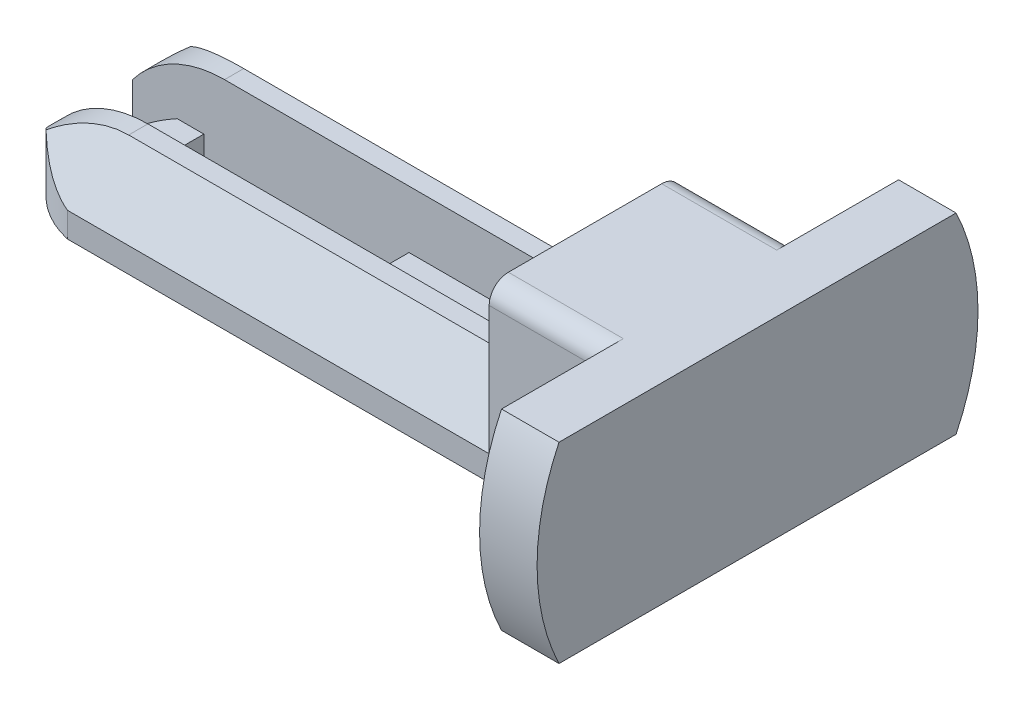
ISO-10303-21;
HEADER;
FILE_DESCRIPTION(('STEP AP214'),'2;1');
FILE_NAME('part.step','',(''),(''),'','','');
FILE_SCHEMA(('AUTOMOTIVE_DESIGN { 1 0 10303 214 1 1 1 1 }'));
ENDSEC;
DATA;
#1=APPLICATION_CONTEXT('core data for automotive mechanical design processes');
#2=APPLICATION_PROTOCOL_DEFINITION('international standard','automotive_design',2000,#1);
#3=PRODUCT_CONTEXT('',#1,'mechanical');
#4=PRODUCT('Part','Part','',(#3));
#5=PRODUCT_RELATED_PRODUCT_CATEGORY('part','',(#4));
#6=PRODUCT_DEFINITION_FORMATION('','',#4);
#7=PRODUCT_DEFINITION_CONTEXT('part definition',#1,'design');
#8=PRODUCT_DEFINITION('design','',#6,#7);
#9=PRODUCT_DEFINITION_SHAPE('','',#8);
#10=(LENGTH_UNIT() NAMED_UNIT(*) SI_UNIT(.MILLI.,.METRE.));
#11=(NAMED_UNIT(*) PLANE_ANGLE_UNIT() SI_UNIT($,.RADIAN.));
#12=(NAMED_UNIT(*) SI_UNIT($,.STERADIAN.) SOLID_ANGLE_UNIT());
#13=UNCERTAINTY_MEASURE_WITH_UNIT(LENGTH_MEASURE(1.E-05),#10,'distance_accuracy_value','');
#14=(GEOMETRIC_REPRESENTATION_CONTEXT(3) GLOBAL_UNCERTAINTY_ASSIGNED_CONTEXT((#13)) GLOBAL_UNIT_ASSIGNED_CONTEXT((#10,
#11,#12)) REPRESENTATION_CONTEXT('',''));
#15=CARTESIAN_POINT('',(0.,0.,0.));
#16=DIRECTION('',(0.,0.,1.));
#17=DIRECTION('',(1.,0.,0.));
#18=AXIS2_PLACEMENT_3D('',#15,#16,#17);
#19=CARTESIAN_POINT('',(1.125,2.3,-5.));
#20=DIRECTION('',(0.,1.,0.));
#21=DIRECTION('',(0.,0.,1.));
#22=AXIS2_PLACEMENT_3D('',#19,#20,#21);
#23=PLANE('',#22);
#24=DIRECTION('',(1.,0.,0.));
#25=VECTOR('',#24,1.);
#26=CARTESIAN_POINT('',(-4.,2.3,-7.));
#27=LINE('',#26,#25);
#28=CARTESIAN_POINT('',(10.8172177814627,2.3,-7.));
#29=VERTEX_POINT('',#28);
#30=CARTESIAN_POINT('',(22.,2.3,-7.));
#31=VERTEX_POINT('',#30);
#32=EDGE_CURVE('E567',#29,#31,#27,.T.);
#33=ORIENTED_EDGE('',*,*,#32,.F.);
#34=DIRECTION('',(0.,0.,-1.));
#35=VECTOR('',#34,1.);
#36=CARTESIAN_POINT('',(10.8172177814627,2.3,-5.));
#37=LINE('',#36,#35);
#38=CARTESIAN_POINT('',(10.8172177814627,2.3,-3.));
#39=VERTEX_POINT('',#38);
#40=EDGE_CURVE('E589',#29,#39,#37,.F.);
#41=ORIENTED_EDGE('',*,*,#40,.T.);
#42=DIRECTION('',(-1.,0.,0.));
#43=VECTOR('',#42,1.);
#44=CARTESIAN_POINT('',(1.125,2.3,-3.));
#45=LINE('',#44,#43);
#46=CARTESIAN_POINT('',(22.,2.3,-3.));
#47=VERTEX_POINT('',#46);
#48=EDGE_CURVE('E569',#47,#39,#45,.T.);
#49=ORIENTED_EDGE('',*,*,#48,.F.);
#50=DIRECTION('',(0.,0.,-1.));
#51=VECTOR('',#50,1.);
#52=CARTESIAN_POINT('',(22.,2.3,0.));
#53=LINE('',#52,#51);
#54=EDGE_CURVE('E372',#47,#31,#53,.T.);
#55=ORIENTED_EDGE('',*,*,#54,.T.);
#56=EDGE_LOOP('',(#33,#41,#49,#55));
#57=FACE_BOUND('',#56,.T.);
#58=ADVANCED_FACE('F35',(#57),#23,.T.);
#59=CARTESIAN_POINT('',(1.125,2.3,-5.));
#60=DIRECTION('',(0.,-1.,0.));
#61=DIRECTION('',(0.,0.,-1.));
#62=AXIS2_PLACEMENT_3D('',#59,#60,#61);
#63=CYLINDRICAL_SURFACE('',#62,5.125);
#64=DIRECTION('',(0.,-1.,0.));
#65=VECTOR('',#64,1.);
#66=CARTESIAN_POINT('',(-3.59364652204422,5.3,-3.));
#67=LINE('',#66,#65);
#68=CARTESIAN_POINT('',(-3.59364652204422,2.91356141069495,-3.));
#69=VERTEX_POINT('',#68);
#70=CARTESIAN_POINT('',(-3.59364652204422,1.,-3.));
#71=VERTEX_POINT('',#70);
#72=EDGE_CURVE('E344',#69,#71,#67,.T.);
#73=ORIENTED_EDGE('',*,*,#72,.T.);
#74=CARTESIAN_POINT('',(1.125,1.,-5.));
#75=DIRECTION('',(0.,1.,0.));
#76=DIRECTION('',(0.,0.,1.));
#77=AXIS2_PLACEMENT_3D('',#74,#75,#76);
#78=CIRCLE('',#77,5.125);
#79=CARTESIAN_POINT('',(0.,1.,0.));
#80=VERTEX_POINT('',#79);
#81=EDGE_CURVE('E677',#71,#80,#78,.T.);
#82=ORIENTED_EDGE('',*,*,#81,.T.);
#83=DIRECTION('',(0.,-1.,0.));
#84=VECTOR('',#83,1.);
#85=CARTESIAN_POINT('',(0.,2.3,0.));
#86=LINE('',#85,#84);
#87=CARTESIAN_POINT('',(0.,2.3,0.));
#88=VERTEX_POINT('',#87);
#89=EDGE_CURVE('E571',#88,#80,#86,.T.);
#90=ORIENTED_EDGE('',*,*,#89,.F.);
#91=CARTESIAN_POINT('',(1.12500000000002,9.80000000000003,-5.00000000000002));
#92=DIRECTION('',(0.,0.554700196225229,0.832050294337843));
#93=DIRECTION('',(0.,-0.832050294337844,0.554700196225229));
#94=AXIS2_PLACEMENT_3D('',#91,#92,#93);
#95=ELLIPSE('',#94,9.23922514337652,5.12500000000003);
#96=CARTESIAN_POINT('',(-2.34544004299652,4.14325539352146,-1.2288369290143));
#97=VERTEX_POINT('',#96);
#98=EDGE_CURVE('E346',#88,#97,#95,.F.);
#99=ORIENTED_EDGE('',*,*,#98,.T.);
#100=CARTESIAN_POINT('',(0.,5.17955945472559,0.));
#101=CARTESIAN_POINT('',(-0.13465374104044,5.15219339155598,-0.0302731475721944));
#102=CARTESIAN_POINT('',(-0.267134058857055,5.12039808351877,-0.0658175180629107));
#103=CARTESIAN_POINT('',(-0.526701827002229,5.04889349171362,-0.146559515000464));
#104=CARTESIAN_POINT('',(-0.653796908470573,5.00919589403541,-0.191742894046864));
#105=CARTESIAN_POINT('',(-0.900609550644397,4.92321211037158,-0.290432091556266));
#106=CARTESIAN_POINT('',(-1.02039192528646,4.87700164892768,-0.343842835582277));
#107=CARTESIAN_POINT('',(-1.2535853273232,4.77857664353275,-0.458541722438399));
#108=CARTESIAN_POINT('',(-1.36699403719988,4.72635993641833,-0.519832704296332));
#109=CARTESIAN_POINT('',(-1.58638369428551,4.61718130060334,-0.649122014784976));
#110=CARTESIAN_POINT('',(-1.69240632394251,4.5602507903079,-0.717076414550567));
#111=CARTESIAN_POINT('',(-1.89761272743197,4.44223933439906,-0.859344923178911));
#112=CARTESIAN_POINT('',(-1.99679727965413,4.38115886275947,-0.933658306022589));
#113=CARTESIAN_POINT('',(-2.18875529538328,4.25536404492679,-1.08848712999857));
#114=CARTESIAN_POINT('',(-2.28149446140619,4.19063315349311,-1.16903154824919));
#115=CARTESIAN_POINT('',(-2.46003025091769,4.05864017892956,-1.33556438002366));
#116=CARTESIAN_POINT('',(-2.54582588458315,3.99137773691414,-1.42155356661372));
#117=CARTESIAN_POINT('',(-2.72993524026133,3.8390825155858,-1.61955027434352));
#118=CARTESIAN_POINT('',(-2.82642772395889,3.75360070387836,-1.73291041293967));
#119=CARTESIAN_POINT('',(-3.00892064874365,3.58171397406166,-1.96711802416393));
#120=CARTESIAN_POINT('',(-3.09492024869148,3.49530898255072,-2.08796609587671));
#121=CARTESIAN_POINT('',(-3.25579890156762,3.32415161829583,-2.33618137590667));
#122=CARTESIAN_POINT('',(-3.33076063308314,3.23939157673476,-2.46348937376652));
#123=CARTESIAN_POINT('',(-3.43531824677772,3.11476433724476,-2.66020646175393));
#124=CARTESIAN_POINT('',(-3.46885952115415,3.07363682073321,-2.72674480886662));
#125=CARTESIAN_POINT('',(-3.53327033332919,2.99259359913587,-2.86183896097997));
#126=CARTESIAN_POINT('',(-3.56413940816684,2.95267810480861,-2.93039511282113));
#127=CARTESIAN_POINT('',(-3.59364652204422,2.91356141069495,-3.));
#128=B_SPLINE_CURVE_WITH_KNOTS('',3,(#100,#101,#102,#103,#104,#105,#106,#107,#108,#109,#110,
#111,#112,#113,#114,#115,#116,#117,#118,#119,#120,#121,#122,#123,#124,#125,#126,#127),
.UNSPECIFIED.,.F.,.F.,(4,2,2,2,2,2,2,2,2,2,2,2,2,4),(0.,0.42180022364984,0.842981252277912,
1.25961706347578,1.67640339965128,2.09060636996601,2.5047621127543,2.92097533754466,
3.33724779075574,3.85171639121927,4.36622620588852,4.87666119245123,5.13192872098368,
5.3872403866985),.UNSPECIFIED.);
#129=EDGE_CURVE('E393',#97,#69,#128,.T.);
#130=ORIENTED_EDGE('',*,*,#129,.T.);
#131=EDGE_LOOP('',(#73,#82,#90,#99,#130));
#132=FACE_BOUND('',#131,.T.);
#133=ADVANCED_FACE('F529',(#132),#63,.T.);
#134=CARTESIAN_POINT('',(0.,1.,-10.));
#135=VERTEX_POINT('',#134);
#136=CARTESIAN_POINT('',(-3.59364652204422,1.,-7.));
#137=VERTEX_POINT('',#136);
#138=EDGE_CURVE('E651',#135,#137,#78,.T.);
#139=ORIENTED_EDGE('',*,*,#138,.T.);
#140=DIRECTION('',(0.,-1.,0.));
#141=VECTOR('',#140,1.);
#142=CARTESIAN_POINT('',(-3.59364652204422,5.3,-7.));
#143=LINE('',#142,#141);
#144=CARTESIAN_POINT('',(-3.59364652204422,2.91356141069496,-7.));
#145=VERTEX_POINT('',#144);
#146=EDGE_CURVE('E349',#145,#137,#143,.T.);
#147=ORIENTED_EDGE('',*,*,#146,.F.);
#148=CARTESIAN_POINT('',(-3.59364652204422,2.91356141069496,-7.));
#149=CARTESIAN_POINT('',(-3.55588890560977,2.96362530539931,-7.08904908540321));
#150=CARTESIAN_POINT('',(-3.51590522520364,3.0149769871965,-7.17639951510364));
#151=CARTESIAN_POINT('',(-3.43158764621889,3.11948906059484,-7.34782692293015));
#152=CARTESIAN_POINT('',(-3.38725486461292,3.17264898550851,-7.43190473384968));
#153=CARTESIAN_POINT('',(-3.29427275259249,3.28009349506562,-7.597042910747));
#154=CARTESIAN_POINT('',(-3.24561893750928,3.33437920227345,-7.67810001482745));
#155=CARTESIAN_POINT('',(-3.14407067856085,3.44343060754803,-7.83717543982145));
#156=CARTESIAN_POINT('',(-3.09117591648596,3.49819634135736,-7.91519353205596));
#157=CARTESIAN_POINT('',(-2.92472262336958,3.66383761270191,-8.14671988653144));
#158=CARTESIAN_POINT('',(-2.80457557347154,3.77466477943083,-8.29560372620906));
#159=CARTESIAN_POINT('',(-2.54687629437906,3.99235392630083,-8.58047288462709));
#160=CARTESIAN_POINT('',(-2.4093365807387,4.09921868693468,-8.71646735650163));
#161=CARTESIAN_POINT('',(-2.16593036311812,4.27096872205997,-8.93092069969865));
#162=CARTESIAN_POINT('',(-2.06496921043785,4.33788474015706,-9.01334722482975));
#163=CARTESIAN_POINT('',(-1.85532280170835,4.46756090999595,-9.17139446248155));
#164=CARTESIAN_POINT('',(-1.74663815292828,4.53032138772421,-9.2470157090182));
#165=CARTESIAN_POINT('',(-1.52246960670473,4.65024609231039,-9.39022635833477));
#166=CARTESIAN_POINT('',(-1.40703955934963,4.70744694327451,-9.45786905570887));
#167=CARTESIAN_POINT('',(-1.16903199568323,4.81570443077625,-9.58489232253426));
#168=CARTESIAN_POINT('',(-1.04645718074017,4.86676336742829,-9.64427598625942));
#169=CARTESIAN_POINT('',(-0.775570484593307,4.96888538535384,-9.76218508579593));
#170=CARTESIAN_POINT('',(-0.626162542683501,5.01879119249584,-9.81923459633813));
#171=CARTESIAN_POINT('',(-0.395951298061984,5.08546898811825,-9.89478467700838));
#172=CARTESIAN_POINT('',(-0.317960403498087,5.10638051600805,-9.91835146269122));
#173=CARTESIAN_POINT('',(-0.160236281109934,5.14523829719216,-9.96190373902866));
#174=CARTESIAN_POINT('',(-0.0805025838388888,5.16318374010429,-9.98188825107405));
#175=CARTESIAN_POINT('',(0.,5.17955945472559,-10.));
#176=B_SPLINE_CURVE_WITH_KNOTS('',3,(#148,#149,#150,#151,#152,#153,#154,#155,#156,#157,#158,
#159,#160,#161,#162,#163,#164,#165,#166,#167,#168,#169,#170,#171,#172,#173,#174,#175),
.UNSPECIFIED.,.F.,.F.,(4,2,2,2,2,2,2,2,2,2,2,2,2,4),(0.,0.326654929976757,0.653226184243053,
0.980140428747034,1.30707922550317,1.96926221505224,2.63097138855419,3.07013006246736,
3.50925424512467,3.94525556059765,4.38109308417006,4.88256386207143,5.13477977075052,
5.38706447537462),.UNSPECIFIED.);
#177=CARTESIAN_POINT('',(-2.34544004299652,4.14325539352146,-8.7711630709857));
#178=VERTEX_POINT('',#177);
#179=EDGE_CURVE('E435',#145,#178,#176,.T.);
#180=ORIENTED_EDGE('',*,*,#179,.T.);
#181=CARTESIAN_POINT('',(1.12500000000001,9.80000000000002,-4.99999999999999));
#182=DIRECTION('',(0.,0.554700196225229,-0.832050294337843));
#183=DIRECTION('',(0.,-0.832050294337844,-0.554700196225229));
#184=AXIS2_PLACEMENT_3D('',#181,#182,#183);
#185=ELLIPSE('',#184,9.2392251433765,5.12500000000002);
#186=CARTESIAN_POINT('',(0.,2.3,-10.));
#187=VERTEX_POINT('',#186);
#188=EDGE_CURVE('E351',#178,#187,#185,.F.);
#189=ORIENTED_EDGE('',*,*,#188,.T.);
#190=DIRECTION('',(0.,-1.,0.));
#191=VECTOR('',#190,1.);
#192=CARTESIAN_POINT('',(0.,2.3,-10.));
#193=LINE('',#192,#191);
#194=EDGE_CURVE('E681',#187,#135,#193,.T.);
#195=ORIENTED_EDGE('',*,*,#194,.T.);
#196=EDGE_LOOP('',(#139,#147,#180,#189,#195));
#197=FACE_BOUND('',#196,.T.);
#198=ADVANCED_FACE('F536',(#197),#63,.T.);
#199=CARTESIAN_POINT('',(0.,2.3,0.));
#200=DIRECTION('',(0.,0.,-1.));
#201=DIRECTION('',(-1.,0.,0.));
#202=AXIS2_PLACEMENT_3D('',#199,#200,#201);
#203=PLANE('',#202);
#204=DIRECTION('',(0.,-1.,0.));
#205=VECTOR('',#204,1.);
#206=CARTESIAN_POINT('',(28.,10.,0.));
#207=LINE('',#206,#205);
#208=CARTESIAN_POINT('',(28.,9.,0.));
#209=VERTEX_POINT('',#208);
#210=CARTESIAN_POINT('',(28.,0.999999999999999,0.));
#211=VERTEX_POINT('',#210);
#212=EDGE_CURVE('E715',#209,#211,#207,.T.);
#213=ORIENTED_EDGE('',*,*,#212,.F.);
#214=DIRECTION('',(-1.,0.,0.));
#215=VECTOR('',#214,1.);
#216=CARTESIAN_POINT('',(0.,9.,0.));
#217=LINE('',#216,#215);
#218=CARTESIAN_POINT('',(22.,9.,0.));
#219=VERTEX_POINT('',#218);
#220=EDGE_CURVE('E717',#209,#219,#217,.T.);
#221=ORIENTED_EDGE('',*,*,#220,.T.);
#222=DIRECTION('',(0.,-1.,0.));
#223=VECTOR('',#222,1.);
#224=CARTESIAN_POINT('',(22.,10.,0.));
#225=LINE('',#224,#223);
#226=CARTESIAN_POINT('',(22.,2.3,0.));
#227=VERTEX_POINT('',#226);
#228=EDGE_CURVE('E267',#219,#227,#225,.T.);
#229=ORIENTED_EDGE('',*,*,#228,.T.);
#230=DIRECTION('',(1.,0.,0.));
#231=VECTOR('',#230,1.);
#232=CARTESIAN_POINT('',(0.,2.3,0.));
#233=LINE('',#232,#231);
#234=EDGE_CURVE('E369',#88,#227,#233,.T.);
#235=ORIENTED_EDGE('',*,*,#234,.F.);
#236=ORIENTED_EDGE('',*,*,#89,.T.);
#237=DIRECTION('',(1.,0.,0.));
#238=VECTOR('',#237,1.);
#239=CARTESIAN_POINT('',(0.,1.,0.));
#240=LINE('',#239,#238);
#241=CARTESIAN_POINT('',(22.,1.,0.));
#242=VERTEX_POINT('',#241);
#243=EDGE_CURVE('E387',#80,#242,#240,.T.);
#244=ORIENTED_EDGE('',*,*,#243,.T.);
#245=DIRECTION('',(-1.,0.,0.));
#246=VECTOR('',#245,1.);
#247=CARTESIAN_POINT('',(0.,1.,0.));
#248=LINE('',#247,#246);
#249=EDGE_CURVE('E716',#242,#211,#248,.F.);
#250=ORIENTED_EDGE('',*,*,#249,.T.);
#251=EDGE_LOOP('',(#213,#221,#229,#235,#236,#244,#250));
#252=FACE_BOUND('',#251,.T.);
#253=ADVANCED_FACE('F551',(#252),#203,.F.);
#254=CARTESIAN_POINT('',(0.,2.3,-10.));
#255=DIRECTION('',(0.,0.,1.));
#256=DIRECTION('',(1.,0.,0.));
#257=AXIS2_PLACEMENT_3D('',#254,#255,#256);
#258=PLANE('',#257);
#259=DIRECTION('',(0.,1.,0.));
#260=VECTOR('',#259,1.);
#261=CARTESIAN_POINT('',(22.,0.,-10.));
#262=LINE('',#261,#260);
#263=CARTESIAN_POINT('',(22.,2.3,-10.));
#264=VERTEX_POINT('',#263);
#265=CARTESIAN_POINT('',(22.,9.,-10.));
#266=VERTEX_POINT('',#265);
#267=EDGE_CURVE('E269',#264,#266,#262,.T.);
#268=ORIENTED_EDGE('',*,*,#267,.T.);
#269=DIRECTION('',(-1.,0.,0.));
#270=VECTOR('',#269,1.);
#271=CARTESIAN_POINT('',(0.,9.,-10.));
#272=LINE('',#271,#270);
#273=CARTESIAN_POINT('',(28.,9.,-10.));
#274=VERTEX_POINT('',#273);
#275=EDGE_CURVE('E718',#266,#274,#272,.F.);
#276=ORIENTED_EDGE('',*,*,#275,.T.);
#277=DIRECTION('',(0.,1.,0.));
#278=VECTOR('',#277,1.);
#279=CARTESIAN_POINT('',(28.,0.,-10.));
#280=LINE('',#279,#278);
#281=CARTESIAN_POINT('',(28.,1.,-10.));
#282=VERTEX_POINT('',#281);
#283=EDGE_CURVE('E300',#282,#274,#280,.T.);
#284=ORIENTED_EDGE('',*,*,#283,.F.);
#285=DIRECTION('',(-1.,0.,0.));
#286=VECTOR('',#285,1.);
#287=CARTESIAN_POINT('',(0.,1.,-10.));
#288=LINE('',#287,#286);
#289=CARTESIAN_POINT('',(22.,1.,-10.));
#290=VERTEX_POINT('',#289);
#291=EDGE_CURVE('E683',#282,#290,#288,.T.);
#292=ORIENTED_EDGE('',*,*,#291,.T.);
#293=DIRECTION('',(-1.,0.,0.));
#294=VECTOR('',#293,1.);
#295=CARTESIAN_POINT('',(0.,1.,-10.));
#296=LINE('',#295,#294);
#297=EDGE_CURVE('E388',#290,#135,#296,.T.);
#298=ORIENTED_EDGE('',*,*,#297,.T.);
#299=ORIENTED_EDGE('',*,*,#194,.F.);
#300=DIRECTION('',(-1.,0.,0.));
#301=VECTOR('',#300,1.);
#302=CARTESIAN_POINT('',(0.,2.3,-10.));
#303=LINE('',#302,#301);
#304=EDGE_CURVE('E687',#264,#187,#303,.T.);
#305=ORIENTED_EDGE('',*,*,#304,.F.);
#306=EDGE_LOOP('',(#268,#276,#284,#292,#298,#299,#305));
#307=FACE_BOUND('',#306,.T.);
#308=ADVANCED_FACE('F541',(#307),#258,.F.);
#309=DIRECTION('',(0.,0.,1.));
#310=VECTOR('',#309,1.);
#311=CARTESIAN_POINT('',(0.11721778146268,2.3,-5.));
#312=LINE('',#311,#310);
#313=CARTESIAN_POINT('',(0.11721778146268,2.3,-7.));
#314=VERTEX_POINT('',#313);
#315=CARTESIAN_POINT('',(0.117217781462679,2.3,-3.));
#316=VERTEX_POINT('',#315);
#317=EDGE_CURVE('E338',#314,#316,#312,.T.);
#318=ORIENTED_EDGE('',*,*,#317,.F.);
#319=CARTESIAN_POINT('',(-1.27617158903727,2.3,-7.));
#320=VERTEX_POINT('',#319);
#321=EDGE_CURVE('E559',#320,#314,#27,.T.);
#322=ORIENTED_EDGE('',*,*,#321,.F.);
#323=CARTESIAN_POINT('',(1.125,2.3,-5.));
#324=DIRECTION('',(0.,1.,0.));
#325=DIRECTION('',(0.,0.,1.));
#326=AXIS2_PLACEMENT_3D('',#323,#324,#325);
#327=CIRCLE('',#326,3.12499999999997);
#328=CARTESIAN_POINT('',(-1.27617158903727,2.3,-3.));
#329=VERTEX_POINT('',#328);
#330=EDGE_CURVE('E580',#320,#329,#327,.T.);
#331=ORIENTED_EDGE('',*,*,#330,.T.);
#332=EDGE_CURVE('E561',#316,#329,#45,.T.);
#333=ORIENTED_EDGE('',*,*,#332,.F.);
#334=EDGE_LOOP('',(#318,#322,#331,#333));
#335=FACE_BOUND('',#334,.T.);
#336=ADVANCED_FACE('F532',(#335),#23,.T.);
#337=CARTESIAN_POINT('',(1.125,0.,-5.));
#338=DIRECTION('',(0.,1.,0.));
#339=DIRECTION('',(0.,0.,1.));
#340=AXIS2_PLACEMENT_3D('',#337,#338,#339);
#341=PLANE('',#340);
#342=DIRECTION('',(0.,0.,-1.));
#343=VECTOR('',#342,1.);
#344=CARTESIAN_POINT('',(0.11721778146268,0.,-3.));
#345=LINE('',#344,#343);
#346=CARTESIAN_POINT('',(0.11721778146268,0.,-2.));
#347=VERTEX_POINT('',#346);
#348=CARTESIAN_POINT('',(0.11721778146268,0.,-8.));
#349=VERTEX_POINT('',#348);
#350=EDGE_CURVE('E332',#347,#349,#345,.T.);
#351=ORIENTED_EDGE('',*,*,#350,.F.);
#352=DIRECTION('',(1.,0.,0.));
#353=VECTOR('',#352,1.);
#354=CARTESIAN_POINT('',(13.1172177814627,0.,-2.));
#355=LINE('',#354,#353);
#356=CARTESIAN_POINT('',(13.1172177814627,0.,-2.));
#357=VERTEX_POINT('',#356);
#358=EDGE_CURVE('E602',#347,#357,#355,.T.);
#359=ORIENTED_EDGE('',*,*,#358,.T.);
#360=DIRECTION('',(0.,0.,-1.));
#361=VECTOR('',#360,1.);
#362=CARTESIAN_POINT('',(13.1172177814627,0.,-5.));
#363=LINE('',#362,#361);
#364=CARTESIAN_POINT('',(13.1172177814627,0.,-8.));
#365=VERTEX_POINT('',#364);
#366=EDGE_CURVE('E588',#357,#365,#363,.T.);
#367=ORIENTED_EDGE('',*,*,#366,.T.);
#368=DIRECTION('',(-1.,0.,0.));
#369=VECTOR('',#368,1.);
#370=CARTESIAN_POINT('',(0.11721778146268,0.,-8.));
#371=LINE('',#370,#369);
#372=EDGE_CURVE('E599',#365,#349,#371,.T.);
#373=ORIENTED_EDGE('',*,*,#372,.T.);
#374=EDGE_LOOP('',(#351,#359,#367,#373));
#375=FACE_BOUND('',#374,.T.);
#376=DIRECTION('',(0.,0.,-1.));
#377=VECTOR('',#376,1.);
#378=CARTESIAN_POINT('',(28.,0.,-15.356157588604));
#379=LINE('',#378,#377);
#380=CARTESIAN_POINT('',(28.,0.,5.35615758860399));
#381=VERTEX_POINT('',#380);
#382=CARTESIAN_POINT('',(28.,0.,-0.999999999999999));
#383=VERTEX_POINT('',#382);
#384=EDGE_CURVE('E50',#381,#383,#379,.T.);
#385=ORIENTED_EDGE('',*,*,#384,.T.);
#386=DIRECTION('',(-1.,0.,0.));
#387=VECTOR('',#386,1.);
#388=CARTESIAN_POINT('',(1.125,0.,-1.));
#389=LINE('',#388,#387);
#390=CARTESIAN_POINT('',(22.,0.,-1.00000000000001));
#391=VERTEX_POINT('',#390);
#392=EDGE_CURVE('E699',#383,#391,#389,.T.);
#393=ORIENTED_EDGE('',*,*,#392,.T.);
#394=DIRECTION('',(-1.,0.,0.));
#395=VECTOR('',#394,1.);
#396=CARTESIAN_POINT('',(1.125,0.,-1.00000000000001));
#397=LINE('',#396,#395);
#398=CARTESIAN_POINT('',(0.117217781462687,0.,-1.00000000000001));
#399=VERTEX_POINT('',#398);
#400=EDGE_CURVE('E410',#391,#399,#397,.T.);
#401=ORIENTED_EDGE('',*,*,#400,.T.);
#402=CARTESIAN_POINT('',(1.125,0.,-5.));
#403=DIRECTION('',(0.,1.,0.));
#404=DIRECTION('',(0.,0.,1.));
#405=AXIS2_PLACEMENT_3D('',#402,#403,#404);
#406=CIRCLE('',#405,4.12499999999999);
#407=CARTESIAN_POINT('',(0.11721778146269,0.,-8.99999999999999));
#408=VERTEX_POINT('',#407);
#409=EDGE_CURVE('E402',#399,#408,#406,.F.);
#410=ORIENTED_EDGE('',*,*,#409,.T.);
#411=DIRECTION('',(1.,0.,0.));
#412=VECTOR('',#411,1.);
#413=CARTESIAN_POINT('',(1.125,0.,-8.99999999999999));
#414=LINE('',#413,#412);
#415=CARTESIAN_POINT('',(22.,0.,-8.99999999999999));
#416=VERTEX_POINT('',#415);
#417=EDGE_CURVE('E412',#408,#416,#414,.T.);
#418=ORIENTED_EDGE('',*,*,#417,.T.);
#419=DIRECTION('',(-1.,0.,0.));
#420=VECTOR('',#419,1.);
#421=CARTESIAN_POINT('',(1.125,0.,-9.));
#422=LINE('',#421,#420);
#423=CARTESIAN_POINT('',(28.,0.,-9.));
#424=VERTEX_POINT('',#423);
#425=EDGE_CURVE('E702',#416,#424,#422,.F.);
#426=ORIENTED_EDGE('',*,*,#425,.T.);
#427=CARTESIAN_POINT('',(28.,0.,-15.356157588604));
#428=VERTEX_POINT('',#427);
#429=EDGE_CURVE('E57',#424,#428,#379,.T.);
#430=ORIENTED_EDGE('',*,*,#429,.T.);
#431=DIRECTION('',(-1.,0.,0.));
#432=VECTOR('',#431,1.);
#433=CARTESIAN_POINT('',(31.,0.,-15.356157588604));
#434=LINE('',#433,#432);
#435=CARTESIAN_POINT('',(31.,0.,-15.356157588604));
#436=VERTEX_POINT('',#435);
#437=EDGE_CURVE('E249',#436,#428,#434,.T.);
#438=ORIENTED_EDGE('',*,*,#437,.F.);
#439=DIRECTION('',(0.,0.,-1.));
#440=VECTOR('',#439,1.);
#441=CARTESIAN_POINT('',(31.,0.,-15.356157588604));
#442=LINE('',#441,#440);
#443=CARTESIAN_POINT('',(31.,0.,5.35615758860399));
#444=VERTEX_POINT('',#443);
#445=EDGE_CURVE('E242',#444,#436,#442,.T.);
#446=ORIENTED_EDGE('',*,*,#445,.F.);
#447=DIRECTION('',(-1.,0.,0.));
#448=VECTOR('',#447,1.);
#449=CARTESIAN_POINT('',(31.,0.,5.35615758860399));
#450=LINE('',#449,#448);
#451=EDGE_CURVE('E246',#444,#381,#450,.T.);
#452=ORIENTED_EDGE('',*,*,#451,.T.);
#453=EDGE_LOOP('',(#385,#393,#401,#410,#418,#426,#430,#438,#446,#452));
#454=FACE_BOUND('',#453,.T.);
#455=ADVANCED_FACE('F244',(#375,#454),#341,.F.);
#456=CARTESIAN_POINT('',(-4.,5.3,-8.));
#457=DIRECTION('',(0.,0.554700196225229,-0.832050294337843));
#458=DIRECTION('',(0.,0.832050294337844,0.554700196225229));
#459=AXIS2_PLACEMENT_3D('',#456,#457,#458);
#460=PLANE('',#459);
#461=ORIENTED_EDGE('',*,*,#188,.F.);
#462=CARTESIAN_POINT('',(1.19615242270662,-0.700000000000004,-12.));
#463=DIRECTION('',(0.,0.554700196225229,-0.832050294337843));
#464=DIRECTION('',(0.,-0.832050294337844,-0.554700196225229));
#465=AXIS2_PLACEMENT_3D('',#462,#463,#464);
#466=ELLIPSE('',#465,7.21110255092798,6.);
#467=CARTESIAN_POINT('',(1.19615242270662,5.3,-8.));
#468=VERTEX_POINT('',#467);
#469=EDGE_CURVE('E445',#178,#468,#466,.T.);
#470=ORIENTED_EDGE('',*,*,#469,.T.);
#471=DIRECTION('',(1.,0.,0.));
#472=VECTOR('',#471,1.);
#473=CARTESIAN_POINT('',(-4.,5.3,-8.));
#474=LINE('',#473,#472);
#475=CARTESIAN_POINT('',(22.,5.3,-8.));
#476=VERTEX_POINT('',#475);
#477=EDGE_CURVE('E637',#468,#476,#474,.T.);
#478=ORIENTED_EDGE('',*,*,#477,.T.);
#479=DIRECTION('',(0.,0.832050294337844,0.554700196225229));
#480=VECTOR('',#479,1.);
#481=CARTESIAN_POINT('',(22.,5.3,-8.));
#482=LINE('',#481,#480);
#483=EDGE_CURVE('E376',#264,#476,#482,.T.);
#484=ORIENTED_EDGE('',*,*,#483,.F.);
#485=ORIENTED_EDGE('',*,*,#304,.T.);
#486=EDGE_LOOP('',(#461,#470,#478,#484,#485));
#487=FACE_BOUND('',#486,.T.);
#488=ADVANCED_FACE('F548',(#487),#460,.T.);
#489=CARTESIAN_POINT('',(-4.,5.3,-7.));
#490=DIRECTION('',(0.,0.,1.));
#491=DIRECTION('',(0.,-1.,0.));
#492=AXIS2_PLACEMENT_3D('',#489,#490,#491);
#493=PLANE('',#492);
#494=DIRECTION('',(0.,-1.,0.));
#495=VECTOR('',#494,1.);
#496=CARTESIAN_POINT('',(0.11721778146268,3.,-7.));
#497=LINE('',#496,#495);
#498=CARTESIAN_POINT('',(0.11721778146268,0.999999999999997,-7.));
#499=VERTEX_POINT('',#498);
#500=EDGE_CURVE('E335',#314,#499,#497,.T.);
#501=ORIENTED_EDGE('',*,*,#500,.T.);
#502=DIRECTION('',(1.,0.,0.));
#503=VECTOR('',#502,1.);
#504=CARTESIAN_POINT('',(13.1172177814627,0.999999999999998,-7.));
#505=LINE('',#504,#503);
#506=CARTESIAN_POINT('',(12.1172177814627,0.999999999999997,-7.));
#507=VERTEX_POINT('',#506);
#508=EDGE_CURVE('E605',#499,#507,#505,.T.);
#509=ORIENTED_EDGE('',*,*,#508,.T.);
#510=DIRECTION('',(0.707106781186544,-0.707106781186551,0.));
#511=VECTOR('',#510,1.);
#512=CARTESIAN_POINT('',(10.1172177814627,3.00000000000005,-7.));
#513=LINE('',#512,#511);
#514=EDGE_CURVE('E594',#507,#29,#513,.F.);
#515=ORIENTED_EDGE('',*,*,#514,.T.);
#516=ORIENTED_EDGE('',*,*,#32,.T.);
#517=DIRECTION('',(0.,-1.,0.));
#518=VECTOR('',#517,1.);
#519=CARTESIAN_POINT('',(22.,5.3,-7.));
#520=LINE('',#519,#518);
#521=CARTESIAN_POINT('',(22.,5.3,-7.));
#522=VERTEX_POINT('',#521);
#523=EDGE_CURVE('E645',#522,#31,#520,.T.);
#524=ORIENTED_EDGE('',*,*,#523,.F.);
#525=DIRECTION('',(1.,0.,0.));
#526=VECTOR('',#525,1.);
#527=CARTESIAN_POINT('',(-4.,5.3,-7.));
#528=LINE('',#527,#526);
#529=CARTESIAN_POINT('',(1.19615242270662,5.3,-7.));
#530=VERTEX_POINT('',#529);
#531=EDGE_CURVE('E373',#530,#522,#528,.T.);
#532=ORIENTED_EDGE('',*,*,#531,.F.);
#533=CARTESIAN_POINT('',(1.19615242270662,-0.700000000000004,-7.));
#534=DIRECTION('',(0.,0.,1.));
#535=DIRECTION('',(0.,-1.,0.));
#536=AXIS2_PLACEMENT_3D('',#533,#534,#535);
#537=CIRCLE('',#536,6.);
#538=EDGE_CURVE('E625',#530,#145,#537,.T.);
#539=ORIENTED_EDGE('',*,*,#538,.T.);
#540=ORIENTED_EDGE('',*,*,#146,.T.);
#541=CARTESIAN_POINT('',(-3.21096874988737,0.649999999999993,-7.));
#542=CARTESIAN_POINT('',(-3.27494911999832,0.708113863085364,-7.));
#543=CARTESIAN_POINT('',(-3.33882912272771,0.766337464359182,-7.));
#544=CARTESIAN_POINT('',(-3.4663883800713,0.8830041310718,-7.));
#545=CARTESIAN_POINT('',(-3.53006763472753,0.941447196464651,-7.));
#546=CARTESIAN_POINT('',(-3.59364652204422,1.,-7.));
#547=B_SPLINE_CURVE_WITH_KNOTS('',3,(#541,#542,#543,#544,#545,#546),.UNSPECIFIED.,.F.,.F.,(4,2,
4),(0.,0.259298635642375,0.51859721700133),.UNSPECIFIED.);
#548=CARTESIAN_POINT('',(-3.21096874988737,0.649999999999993,-7.));
#549=VERTEX_POINT('',#548);
#550=EDGE_CURVE('E653',#549,#137,#547,.T.);
#551=ORIENTED_EDGE('',*,*,#550,.F.);
#552=CARTESIAN_POINT('',(-3.59364652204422,0.299999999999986,-7.));
#553=CARTESIAN_POINT('',(-3.49977902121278,0.386422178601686,-7.));
#554=CARTESIAN_POINT('',(-3.40571960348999,0.472635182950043,-7.));
#555=CARTESIAN_POINT('',(-3.2171379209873,0.64455429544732,-7.));
#556=CARTESIAN_POINT('',(-3.1226156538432,0.730260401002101,-7.));
#557=CARTESIAN_POINT('',(-2.83831988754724,0.986409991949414,-7.));
#558=CARTESIAN_POINT('',(-2.64773597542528,1.15596001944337,-7.));
#559=CARTESIAN_POINT('',(-2.35947284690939,1.40761530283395,-7.));
#560=CARTESIAN_POINT('',(-2.26297114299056,1.49106898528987,-7.));
#561=CARTESIAN_POINT('',(-2.06899654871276,1.65683398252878,-7.));
#562=CARTESIAN_POINT('',(-1.97152369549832,1.73914534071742,-7.));
#563=CARTESIAN_POINT('',(-1.77533522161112,1.9023654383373,-7.));
#564=CARTESIAN_POINT('',(-1.67661908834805,1.98327356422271,-7.));
#565=CARTESIAN_POINT('',(-1.47763770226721,2.1431863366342,-7.));
#566=CARTESIAN_POINT('',(-1.37737224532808,2.22219072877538,-7.));
#567=CARTESIAN_POINT('',(-1.27617158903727,2.3,-7.));
#568=B_SPLINE_CURVE_WITH_KNOTS('',3,(#552,#553,#554,#555,#556,#557,#558,#559,#560,#561,#562,
#563,#564,#565,#566,#567),.UNSPECIFIED.,.F.,.F.,(4,2,2,2,2,2,2,4),(0.,0.382776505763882,
0.765554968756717,1.53077920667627,1.91351763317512,2.29624147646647,2.67912864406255,
3.06206669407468),.UNSPECIFIED.);
#569=EDGE_CURVE('E485',#549,#320,#568,.T.);
#570=ORIENTED_EDGE('',*,*,#569,.T.);
#571=ORIENTED_EDGE('',*,*,#321,.T.);
#572=EDGE_LOOP('',(#501,#509,#515,#516,#524,#532,#539,#540,#551,#570,#571));
#573=FACE_BOUND('',#572,.T.);
#574=ADVANCED_FACE('F467',(#573),#493,.T.);
#575=CARTESIAN_POINT('',(-4.,5.3,-7.));
#576=DIRECTION('',(0.,1.,0.));
#577=DIRECTION('',(0.,0.,1.));
#578=AXIS2_PLACEMENT_3D('',#575,#576,#577);
#579=PLANE('',#578);
#580=ORIENTED_EDGE('',*,*,#477,.F.);
#581=DIRECTION('',(0.,0.,1.));
#582=VECTOR('',#581,1.);
#583=CARTESIAN_POINT('',(1.19615242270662,5.3,-6.99999999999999));
#584=LINE('',#583,#582);
#585=EDGE_CURVE('E623',#468,#530,#584,.T.);
#586=ORIENTED_EDGE('',*,*,#585,.T.);
#587=ORIENTED_EDGE('',*,*,#531,.T.);
#588=DIRECTION('',(0.,0.,1.));
#589=VECTOR('',#588,1.);
#590=CARTESIAN_POINT('',(22.,5.3,-7.));
#591=LINE('',#590,#589);
#592=EDGE_CURVE('E379',#476,#522,#591,.T.);
#593=ORIENTED_EDGE('',*,*,#592,.F.);
#594=EDGE_LOOP('',(#580,#586,#587,#593));
#595=FACE_BOUND('',#594,.T.);
#596=ADVANCED_FACE('F458',(#595),#579,.T.);
#597=CARTESIAN_POINT('',(-4.,5.3,-2.));
#598=DIRECTION('',(0.,0.554700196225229,0.832050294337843));
#599=DIRECTION('',(0.,-0.832050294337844,0.554700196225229));
#600=AXIS2_PLACEMENT_3D('',#597,#598,#599);
#601=PLANE('',#600);
#602=ORIENTED_EDGE('',*,*,#98,.F.);
#603=ORIENTED_EDGE('',*,*,#234,.T.);
#604=DIRECTION('',(0.,-0.832050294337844,0.554700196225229));
#605=VECTOR('',#604,1.);
#606=CARTESIAN_POINT('',(22.,5.3,-2.));
#607=LINE('',#606,#605);
#608=CARTESIAN_POINT('',(22.,5.3,-2.));
#609=VERTEX_POINT('',#608);
#610=EDGE_CURVE('E358',#609,#227,#607,.T.);
#611=ORIENTED_EDGE('',*,*,#610,.F.);
#612=DIRECTION('',(1.,0.,0.));
#613=VECTOR('',#612,1.);
#614=CARTESIAN_POINT('',(-4.,5.3,-2.));
#615=LINE('',#614,#613);
#616=CARTESIAN_POINT('',(1.19615242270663,5.3,-2.));
#617=VERTEX_POINT('',#616);
#618=EDGE_CURVE('E361',#617,#609,#615,.T.);
#619=ORIENTED_EDGE('',*,*,#618,.F.);
#620=CARTESIAN_POINT('',(1.19615242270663,-0.699999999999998,2.));
#621=DIRECTION('',(0.,0.554700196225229,0.832050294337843));
#622=DIRECTION('',(0.,-0.832050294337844,0.554700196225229));
#623=AXIS2_PLACEMENT_3D('',#620,#621,#622);
#624=ELLIPSE('',#623,7.21110255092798,6.);
#625=EDGE_CURVE('E425',#617,#97,#624,.T.);
#626=ORIENTED_EDGE('',*,*,#625,.T.);
#627=EDGE_LOOP('',(#602,#603,#611,#619,#626));
#628=FACE_BOUND('',#627,.T.);
#629=ADVANCED_FACE('F454',(#628),#601,.T.);
#630=CARTESIAN_POINT('',(-4.,5.3,-3.));
#631=DIRECTION('',(0.,1.,0.));
#632=DIRECTION('',(0.,0.,1.));
#633=AXIS2_PLACEMENT_3D('',#630,#631,#632);
#634=PLANE('',#633);
#635=DIRECTION('',(1.,0.,0.));
#636=VECTOR('',#635,1.);
#637=CARTESIAN_POINT('',(-4.,5.3,-3.));
#638=LINE('',#637,#636);
#639=CARTESIAN_POINT('',(1.19615242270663,5.3,-3.));
#640=VERTEX_POINT('',#639);
#641=CARTESIAN_POINT('',(22.,5.3,-3.));
#642=VERTEX_POINT('',#641);
#643=EDGE_CURVE('E367',#640,#642,#638,.T.);
#644=ORIENTED_EDGE('',*,*,#643,.F.);
#645=DIRECTION('',(0.,0.,-1.));
#646=VECTOR('',#645,1.);
#647=CARTESIAN_POINT('',(1.19615242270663,5.3,-2.));
#648=LINE('',#647,#646);
#649=EDGE_CURVE('E430',#640,#617,#648,.F.);
#650=ORIENTED_EDGE('',*,*,#649,.T.);
#651=ORIENTED_EDGE('',*,*,#618,.T.);
#652=DIRECTION('',(0.,0.,1.));
#653=VECTOR('',#652,1.);
#654=CARTESIAN_POINT('',(22.,5.3,-3.));
#655=LINE('',#654,#653);
#656=EDGE_CURVE('E355',#642,#609,#655,.T.);
#657=ORIENTED_EDGE('',*,*,#656,.F.);
#658=EDGE_LOOP('',(#644,#650,#651,#657));
#659=FACE_BOUND('',#658,.T.);
#660=ADVANCED_FACE('F457',(#659),#634,.T.);
#661=CARTESIAN_POINT('',(-4.,5.3,-3.));
#662=DIRECTION('',(0.,0.,-1.));
#663=DIRECTION('',(-1.,0.,0.));
#664=AXIS2_PLACEMENT_3D('',#661,#662,#663);
#665=PLANE('',#664);
#666=DIRECTION('',(-0.707106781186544,0.707106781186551,0.));
#667=VECTOR('',#666,1.);
#668=CARTESIAN_POINT('',(10.1172177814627,3.00000000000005,-3.));
#669=LINE('',#668,#667);
#670=CARTESIAN_POINT('',(12.1172177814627,0.999999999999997,-3.));
#671=VERTEX_POINT('',#670);
#672=EDGE_CURVE('E591',#39,#671,#669,.F.);
#673=ORIENTED_EDGE('',*,*,#672,.T.);
#674=DIRECTION('',(-1.,0.,0.));
#675=VECTOR('',#674,1.);
#676=CARTESIAN_POINT('',(0.11721778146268,0.999999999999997,-3.));
#677=LINE('',#676,#675);
#678=CARTESIAN_POINT('',(0.11721778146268,0.999999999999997,-3.));
#679=VERTEX_POINT('',#678);
#680=EDGE_CURVE('E596',#671,#679,#677,.T.);
#681=ORIENTED_EDGE('',*,*,#680,.T.);
#682=DIRECTION('',(0.,-1.,0.));
#683=VECTOR('',#682,1.);
#684=CARTESIAN_POINT('',(0.11721778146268,3.,-3.));
#685=LINE('',#684,#683);
#686=EDGE_CURVE('E334',#316,#679,#685,.T.);
#687=ORIENTED_EDGE('',*,*,#686,.F.);
#688=ORIENTED_EDGE('',*,*,#332,.T.);
#689=CARTESIAN_POINT('',(-1.27617158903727,2.3,-3.));
#690=CARTESIAN_POINT('',(-1.37737224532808,2.22219072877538,-3.));
#691=CARTESIAN_POINT('',(-1.47763770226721,2.1431863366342,-3.));
#692=CARTESIAN_POINT('',(-1.67661908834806,1.98327356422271,-3.));
#693=CARTESIAN_POINT('',(-1.77533522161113,1.9023654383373,-3.));
#694=CARTESIAN_POINT('',(-1.97152369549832,1.73914534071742,-3.));
#695=CARTESIAN_POINT('',(-2.06899654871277,1.65683398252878,-3.));
#696=CARTESIAN_POINT('',(-2.26297114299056,1.49106898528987,-3.));
#697=CARTESIAN_POINT('',(-2.35947284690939,1.40761530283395,-3.));
#698=CARTESIAN_POINT('',(-2.64773597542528,1.15596001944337,-3.));
#699=CARTESIAN_POINT('',(-2.83831988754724,0.986409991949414,-3.));
#700=CARTESIAN_POINT('',(-3.1226156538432,0.730260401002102,-3.));
#701=CARTESIAN_POINT('',(-3.2171379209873,0.644554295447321,-3.));
#702=CARTESIAN_POINT('',(-3.40571960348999,0.472635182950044,-3.));
#703=CARTESIAN_POINT('',(-3.49977902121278,0.386422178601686,-3.));
#704=CARTESIAN_POINT('',(-3.59364652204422,0.299999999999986,-3.));
#705=B_SPLINE_CURVE_WITH_KNOTS('',3,(#689,#690,#691,#692,#693,#694,#695,#696,#697,#698,#699,
#700,#701,#702,#703,#704),.UNSPECIFIED.,.F.,.F.,(4,2,2,2,2,2,2,4),(0.,0.382938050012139,
0.765825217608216,1.14854906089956,1.53128748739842,2.29651172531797,2.6792901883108,
3.06206669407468),.UNSPECIFIED.);
#706=CARTESIAN_POINT('',(-3.21096874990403,0.650000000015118,-3.));
#707=VERTEX_POINT('',#706);
#708=EDGE_CURVE('E479',#329,#707,#705,.T.);
#709=ORIENTED_EDGE('',*,*,#708,.T.);
#710=CARTESIAN_POINT('',(-3.59364652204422,1.,-3.));
#711=CARTESIAN_POINT('',(-3.53006763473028,0.941447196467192,-3.));
#712=CARTESIAN_POINT('',(-3.46638838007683,0.883004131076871,-3.));
#713=CARTESIAN_POINT('',(-3.33882912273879,0.766337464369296,-3.));
#714=CARTESIAN_POINT('',(-3.27494912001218,0.708113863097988,-3.));
#715=CARTESIAN_POINT('',(-3.21096874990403,0.650000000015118,-3.));
#716=B_SPLINE_CURVE_WITH_KNOTS('',3,(#710,#711,#712,#713,#714,#715),.UNSPECIFIED.,.F.,.F.,(4,2,
4),(0.,0.259298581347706,0.518597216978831),.UNSPECIFIED.);
#717=EDGE_CURVE('E472',#71,#707,#716,.T.);
#718=ORIENTED_EDGE('',*,*,#717,.F.);
#719=ORIENTED_EDGE('',*,*,#72,.F.);
#720=CARTESIAN_POINT('',(1.19615242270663,-0.699999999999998,-3.));
#721=DIRECTION('',(0.,0.,-1.));
#722=DIRECTION('',(-1.,0.,0.));
#723=AXIS2_PLACEMENT_3D('',#720,#721,#722);
#724=CIRCLE('',#723,6.);
#725=EDGE_CURVE('E421',#69,#640,#724,.T.);
#726=ORIENTED_EDGE('',*,*,#725,.T.);
#727=ORIENTED_EDGE('',*,*,#643,.T.);
#728=DIRECTION('',(0.,1.,0.));
#729=VECTOR('',#728,1.);
#730=CARTESIAN_POINT('',(22.,5.3,-3.));
#731=LINE('',#730,#729);
#732=EDGE_CURVE('E352',#47,#642,#731,.T.);
#733=ORIENTED_EDGE('',*,*,#732,.F.);
#734=ORIENTED_EDGE('',*,*,#48,.T.);
#735=EDGE_LOOP('',(#673,#681,#687,#688,#709,#718,#719,#726,#727,#733,#734));
#736=FACE_BOUND('',#735,.T.);
#737=ADVANCED_FACE('F462',(#736),#665,.T.);
#738=CARTESIAN_POINT('',(1.19615242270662,-0.700000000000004,0.));
#739=DIRECTION('',(0.,0.,-1.));
#740=DIRECTION('',(-1.,0.,0.));
#741=AXIS2_PLACEMENT_3D('',#738,#739,#740);
#742=CYLINDRICAL_SURFACE('',#741,6.);
#743=ORIENTED_EDGE('',*,*,#179,.F.);
#744=ORIENTED_EDGE('',*,*,#538,.F.);
#745=ORIENTED_EDGE('',*,*,#585,.F.);
#746=ORIENTED_EDGE('',*,*,#469,.F.);
#747=EDGE_LOOP('',(#743,#744,#745,#746));
#748=FACE_BOUND('',#747,.T.);
#749=ADVANCED_FACE('F447',(#748),#742,.T.);
#750=CARTESIAN_POINT('',(1.19615242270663,-0.699999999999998,0.));
#751=DIRECTION('',(0.,0.,1.));
#752=DIRECTION('',(1.,0.,0.));
#753=AXIS2_PLACEMENT_3D('',#750,#751,#752);
#754=CYLINDRICAL_SURFACE('',#753,6.);
#755=ORIENTED_EDGE('',*,*,#129,.F.);
#756=ORIENTED_EDGE('',*,*,#625,.F.);
#757=ORIENTED_EDGE('',*,*,#649,.F.);
#758=ORIENTED_EDGE('',*,*,#725,.F.);
#759=EDGE_LOOP('',(#755,#756,#757,#758));
#760=FACE_BOUND('',#759,.T.);
#761=ADVANCED_FACE('F667',(#760),#754,.T.);
#762=CARTESIAN_POINT('',(0.,1.,-10.));
#763=DIRECTION('',(0.,0.707106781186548,0.707106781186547));
#764=DIRECTION('',(-1.,0.,0.));
#765=AXIS2_PLACEMENT_3D('',#762,#763,#764);
#766=PLANE('',#765);
#767=DIRECTION('',(0.,-0.707106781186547,0.707106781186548));
#768=VECTOR('',#767,1.);
#769=CARTESIAN_POINT('',(22.,1.,-10.));
#770=LINE('',#769,#768);
#771=EDGE_CURVE('E382',#416,#290,#770,.F.);
#772=ORIENTED_EDGE('',*,*,#771,.F.);
#773=ORIENTED_EDGE('',*,*,#417,.F.);
#774=CARTESIAN_POINT('',(0.,1.,-10.));
#775=CARTESIAN_POINT('',(0.018470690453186,0.833270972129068,-9.83327097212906));
#776=CARTESIAN_POINT('',(0.0374741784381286,0.666573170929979,-9.66657317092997));
#777=CARTESIAN_POINT('',(0.0765467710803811,0.333239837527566,-9.33323983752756));
#778=CARTESIAN_POINT('',(0.0966158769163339,0.16660430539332,-9.16660430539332));
#779=CARTESIAN_POINT('',(0.117217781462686,0.,-8.99999999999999));
#780=B_SPLINE_CURVE_WITH_KNOTS('',3,(#774,#775,#776,#777,#778,#779),.UNSPECIFIED.,.F.,.F.,(4,2,
4),(0.,0.709532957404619,1.41906669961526),.UNSPECIFIED.);
#781=EDGE_CURVE('E347',#135,#408,#780,.T.);
#782=ORIENTED_EDGE('',*,*,#781,.F.);
#783=ORIENTED_EDGE('',*,*,#297,.F.);
#784=EDGE_LOOP('',(#772,#773,#782,#783));
#785=FACE_BOUND('',#784,.T.);
#786=ADVANCED_FACE('F498',(#785),#766,.F.);
#787=CARTESIAN_POINT('',(1.125,1.,-5.));
#788=DIRECTION('',(0.,1.,0.));
#789=DIRECTION('',(0.,0.,1.));
#790=AXIS2_PLACEMENT_3D('',#787,#788,#789);
#791=CONICAL_SURFACE('',#790,5.125,0.78539816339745);
#792=ORIENTED_EDGE('',*,*,#81,.F.);
#793=ORIENTED_EDGE('',*,*,#717,.T.);
#794=CARTESIAN_POINT('',(1.125,0.649999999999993,-5.));
#795=DIRECTION('',(0.,-1.,0.));
#796=DIRECTION('',(0.,0.,-1.));
#797=AXIS2_PLACEMENT_3D('',#794,#795,#796);
#798=CIRCLE('',#797,4.77499999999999);
#799=EDGE_CURVE('E661',#707,#549,#798,.T.);
#800=ORIENTED_EDGE('',*,*,#799,.T.);
#801=ORIENTED_EDGE('',*,*,#550,.T.);
#802=ORIENTED_EDGE('',*,*,#138,.F.);
#803=ORIENTED_EDGE('',*,*,#781,.T.);
#804=ORIENTED_EDGE('',*,*,#409,.F.);
#805=CARTESIAN_POINT('',(0.117217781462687,0.,-1.00000000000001));
#806=CARTESIAN_POINT('',(0.0966158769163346,0.16660430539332,-0.833395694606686));
#807=CARTESIAN_POINT('',(0.0765467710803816,0.333239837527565,-0.666760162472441));
#808=CARTESIAN_POINT('',(0.0374741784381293,0.666573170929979,-0.333426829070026));
#809=CARTESIAN_POINT('',(0.0184706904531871,0.833270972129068,-0.166729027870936));
#810=CARTESIAN_POINT('',(0.,1.,0.));
#811=B_SPLINE_CURVE_WITH_KNOTS('',3,(#805,#806,#807,#808,#809,#810),.UNSPECIFIED.,.F.,.F.,(4,2,
4),(0.,0.709533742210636,1.41906669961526),.UNSPECIFIED.);
#812=EDGE_CURVE('E343',#80,#399,#811,.F.);
#813=ORIENTED_EDGE('',*,*,#812,.F.);
#814=EDGE_LOOP('',(#792,#793,#800,#801,#802,#803,#804,#813));
#815=FACE_BOUND('',#814,.T.);
#816=ADVANCED_FACE('F657',(#815),#791,.T.);
#817=CARTESIAN_POINT('',(0.,1.,0.));
#818=DIRECTION('',(0.,0.707106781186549,-0.707106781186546));
#819=DIRECTION('',(1.,0.,0.));
#820=AXIS2_PLACEMENT_3D('',#817,#818,#819);
#821=PLANE('',#820);
#822=ORIENTED_EDGE('',*,*,#812,.T.);
#823=ORIENTED_EDGE('',*,*,#400,.F.);
#824=DIRECTION('',(0.,0.707106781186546,0.707106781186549));
#825=VECTOR('',#824,1.);
#826=CARTESIAN_POINT('',(22.,1.,0.));
#827=LINE('',#826,#825);
#828=EDGE_CURVE('E386',#242,#391,#827,.F.);
#829=ORIENTED_EDGE('',*,*,#828,.F.);
#830=ORIENTED_EDGE('',*,*,#243,.F.);
#831=EDGE_LOOP('',(#822,#823,#829,#830));
#832=FACE_BOUND('',#831,.T.);
#833=ADVANCED_FACE('F496',(#832),#821,.F.);
#834=CARTESIAN_POINT('',(1.125,2.3,-5.));
#835=DIRECTION('',(0.,-1.,0.));
#836=DIRECTION('',(0.,0.,-1.));
#837=AXIS2_PLACEMENT_3D('',#834,#835,#836);
#838=CONICAL_SURFACE('',#837,3.12499999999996,0.785398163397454);
#839=ORIENTED_EDGE('',*,*,#569,.F.);
#840=ORIENTED_EDGE('',*,*,#799,.F.);
#841=ORIENTED_EDGE('',*,*,#708,.F.);
#842=ORIENTED_EDGE('',*,*,#330,.F.);
#843=EDGE_LOOP('',(#839,#840,#841,#842));
#844=FACE_BOUND('',#843,.T.);
#845=ADVANCED_FACE('F490',(#844),#838,.T.);
#846=CARTESIAN_POINT('',(0.11721778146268,3.,-3.));
#847=DIRECTION('',(-1.,0.,0.));
#848=DIRECTION('',(0.,0.,1.));
#849=AXIS2_PLACEMENT_3D('',#846,#847,#848);
#850=PLANE('',#849);
#851=ORIENTED_EDGE('',*,*,#317,.T.);
#852=ORIENTED_EDGE('',*,*,#686,.T.);
#853=DIRECTION('',(0.,-0.707106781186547,0.707106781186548));
#854=VECTOR('',#853,1.);
#855=CARTESIAN_POINT('',(0.11721778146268,2.,-4.));
#856=LINE('',#855,#854);
#857=EDGE_CURVE('E607',#679,#347,#856,.T.);
#858=ORIENTED_EDGE('',*,*,#857,.T.);
#859=ORIENTED_EDGE('',*,*,#350,.T.);
#860=DIRECTION('',(0.,0.707106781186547,0.707106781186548));
#861=VECTOR('',#860,1.);
#862=CARTESIAN_POINT('',(0.11721778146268,4.,-4.));
#863=LINE('',#862,#861);
#864=EDGE_CURVE('E316',#349,#499,#863,.T.);
#865=ORIENTED_EDGE('',*,*,#864,.T.);
#866=ORIENTED_EDGE('',*,*,#500,.F.);
#867=EDGE_LOOP('',(#851,#852,#858,#859,#865,#866));
#868=FACE_BOUND('',#867,.T.);
#869=ADVANCED_FACE('F495',(#868),#850,.F.);
#870=CARTESIAN_POINT('',(10.1172177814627,3.00000000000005,-3.));
#871=DIRECTION('',(0.707106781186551,0.707106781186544,0.));
#872=DIRECTION('',(0.,0.,1.));
#873=AXIS2_PLACEMENT_3D('',#870,#871,#872);
#874=PLANE('',#873);
#875=ORIENTED_EDGE('',*,*,#514,.F.);
#876=DIRECTION('',(-0.577350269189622,0.577350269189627,0.577350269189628));
#877=VECTOR('',#876,1.);
#878=CARTESIAN_POINT('',(6.74481185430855,6.37240592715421,-1.62759407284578));
#879=LINE('',#878,#877);
#880=EDGE_CURVE('E611',#507,#365,#879,.F.);
#881=ORIENTED_EDGE('',*,*,#880,.T.);
#882=ORIENTED_EDGE('',*,*,#366,.F.);
#883=DIRECTION('',(0.577350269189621,-0.577350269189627,0.577350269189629));
#884=VECTOR('',#883,1.);
#885=CARTESIAN_POINT('',(6.74481185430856,6.37240592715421,-8.37240592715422));
#886=LINE('',#885,#884);
#887=EDGE_CURVE('E610',#357,#671,#886,.F.);
#888=ORIENTED_EDGE('',*,*,#887,.T.);
#889=ORIENTED_EDGE('',*,*,#672,.F.);
#890=ORIENTED_EDGE('',*,*,#40,.F.);
#891=EDGE_LOOP('',(#875,#881,#882,#888,#889,#890));
#892=FACE_BOUND('',#891,.T.);
#893=ADVANCED_FACE('F501',(#892),#874,.F.);
#894=CARTESIAN_POINT('',(-4.,0.999999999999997,-3.));
#895=DIRECTION('',(0.,-0.707106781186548,-0.707106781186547));
#896=DIRECTION('',(1.,0.,0.));
#897=AXIS2_PLACEMENT_3D('',#894,#895,#896);
#898=PLANE('',#897);
#899=ORIENTED_EDGE('',*,*,#887,.F.);
#900=ORIENTED_EDGE('',*,*,#358,.F.);
#901=ORIENTED_EDGE('',*,*,#857,.F.);
#902=ORIENTED_EDGE('',*,*,#680,.F.);
#903=EDGE_LOOP('',(#899,#900,#901,#902));
#904=FACE_BOUND('',#903,.T.);
#905=ADVANCED_FACE('F505',(#904),#898,.T.);
#906=CARTESIAN_POINT('',(-4.,0.999999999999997,-7.));
#907=DIRECTION('',(0.,-0.707106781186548,0.707106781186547));
#908=DIRECTION('',(-1.,0.,0.));
#909=AXIS2_PLACEMENT_3D('',#906,#907,#908);
#910=PLANE('',#909);
#911=ORIENTED_EDGE('',*,*,#864,.F.);
#912=ORIENTED_EDGE('',*,*,#372,.F.);
#913=ORIENTED_EDGE('',*,*,#880,.F.);
#914=ORIENTED_EDGE('',*,*,#508,.F.);
#915=EDGE_LOOP('',(#911,#912,#913,#914));
#916=FACE_BOUND('',#915,.T.);
#917=ADVANCED_FACE('F509',(#916),#910,.T.);
#918=CARTESIAN_POINT('',(22.,0.,0.));
#919=DIRECTION('',(1.,0.,0.));
#920=DIRECTION('',(0.,0.,-1.));
#921=AXIS2_PLACEMENT_3D('',#918,#919,#920);
#922=PLANE('',#921);
#923=ORIENTED_EDGE('',*,*,#828,.T.);
#924=CARTESIAN_POINT('',(22.,1.,-1.));
#925=DIRECTION('',(1.,0.,0.));
#926=DIRECTION('',(0.,0.,-1.));
#927=AXIS2_PLACEMENT_3D('',#924,#925,#926);
#928=CIRCLE('',#927,1.);
#929=EDGE_CURVE('E697',#391,#242,#928,.F.);
#930=ORIENTED_EDGE('',*,*,#929,.T.);
#931=EDGE_LOOP('',(#923,#930));
#932=FACE_BOUND('',#931,.T.);
#933=ADVANCED_FACE('F513',(#932),#922,.F.);
#934=ORIENTED_EDGE('',*,*,#771,.T.);
#935=CARTESIAN_POINT('',(22.,1.,-9.));
#936=DIRECTION('',(1.,0.,0.));
#937=DIRECTION('',(0.,0.,-1.));
#938=AXIS2_PLACEMENT_3D('',#935,#936,#937);
#939=CIRCLE('',#938,1.);
#940=EDGE_CURVE('E304',#290,#416,#939,.F.);
#941=ORIENTED_EDGE('',*,*,#940,.T.);
#942=EDGE_LOOP('',(#934,#941));
#943=FACE_BOUND('',#942,.T.);
#944=ADVANCED_FACE('F778',(#943),#922,.F.);
#945=DIRECTION('',(0.,0.,1.));
#946=VECTOR('',#945,1.);
#947=CARTESIAN_POINT('',(22.,10.,-10.));
#948=LINE('',#947,#946);
#949=CARTESIAN_POINT('',(22.,10.,-9.));
#950=VERTEX_POINT('',#949);
#951=CARTESIAN_POINT('',(22.,10.,-0.999999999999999));
#952=VERTEX_POINT('',#951);
#953=EDGE_CURVE('E328',#950,#952,#948,.T.);
#954=ORIENTED_EDGE('',*,*,#953,.F.);
#955=CARTESIAN_POINT('',(22.,9.,-9.));
#956=DIRECTION('',(1.,0.,0.));
#957=DIRECTION('',(0.,0.,-1.));
#958=AXIS2_PLACEMENT_3D('',#955,#956,#957);
#959=CIRCLE('',#958,1.);
#960=EDGE_CURVE('E308',#950,#266,#959,.F.);
#961=ORIENTED_EDGE('',*,*,#960,.T.);
#962=ORIENTED_EDGE('',*,*,#267,.F.);
#963=ORIENTED_EDGE('',*,*,#483,.T.);
#964=ORIENTED_EDGE('',*,*,#592,.T.);
#965=ORIENTED_EDGE('',*,*,#523,.T.);
#966=ORIENTED_EDGE('',*,*,#54,.F.);
#967=ORIENTED_EDGE('',*,*,#732,.T.);
#968=ORIENTED_EDGE('',*,*,#656,.T.);
#969=ORIENTED_EDGE('',*,*,#610,.T.);
#970=ORIENTED_EDGE('',*,*,#228,.F.);
#971=CARTESIAN_POINT('',(22.,9.,-1.));
#972=DIRECTION('',(1.,0.,0.));
#973=DIRECTION('',(0.,0.,-1.));
#974=AXIS2_PLACEMENT_3D('',#971,#972,#973);
#975=CIRCLE('',#974,1.);
#976=EDGE_CURVE('E311',#219,#952,#975,.F.);
#977=ORIENTED_EDGE('',*,*,#976,.T.);
#978=EDGE_LOOP('',(#954,#961,#962,#963,#964,#965,#966,#967,#968,#969,#970,#977));
#979=FACE_BOUND('',#978,.T.);
#980=ADVANCED_FACE('F737',(#979),#922,.F.);
#981=CARTESIAN_POINT('',(28.,10.,-10.));
#982=DIRECTION('',(0.,-1.,0.));
#983=DIRECTION('',(0.,0.,-1.));
#984=AXIS2_PLACEMENT_3D('',#981,#982,#983);
#985=PLANE('',#984);
#986=DIRECTION('',(0.,0.,1.));
#987=VECTOR('',#986,1.);
#988=CARTESIAN_POINT('',(28.,10.,5.35615758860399));
#989=LINE('',#988,#987);
#990=CARTESIAN_POINT('',(28.,10.,-15.356157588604));
#991=VERTEX_POINT('',#990);
#992=CARTESIAN_POINT('',(28.,10.,-9.));
#993=VERTEX_POINT('',#992);
#994=EDGE_CURVE('E262',#991,#993,#989,.T.);
#995=ORIENTED_EDGE('',*,*,#994,.T.);
#996=DIRECTION('',(-1.,0.,0.));
#997=VECTOR('',#996,1.);
#998=CARTESIAN_POINT('',(28.,10.,-9.));
#999=LINE('',#998,#997);
#1000=EDGE_CURVE('E306',#993,#950,#999,.T.);
#1001=ORIENTED_EDGE('',*,*,#1000,.T.);
#1002=ORIENTED_EDGE('',*,*,#953,.T.);
#1003=DIRECTION('',(-1.,0.,0.));
#1004=VECTOR('',#1003,1.);
#1005=CARTESIAN_POINT('',(28.,10.,-0.999999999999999));
#1006=LINE('',#1005,#1004);
#1007=CARTESIAN_POINT('',(28.,10.,-1.));
#1008=VERTEX_POINT('',#1007);
#1009=EDGE_CURVE('E312',#952,#1008,#1006,.F.);
#1010=ORIENTED_EDGE('',*,*,#1009,.T.);
#1011=CARTESIAN_POINT('',(28.,10.,5.35615758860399));
#1012=VERTEX_POINT('',#1011);
#1013=EDGE_CURVE('E277',#1008,#1012,#989,.T.);
#1014=ORIENTED_EDGE('',*,*,#1013,.T.);
#1015=DIRECTION('',(-1.,0.,0.));
#1016=VECTOR('',#1015,1.);
#1017=CARTESIAN_POINT('',(31.,10.,5.35615758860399));
#1018=LINE('',#1017,#1016);
#1019=CARTESIAN_POINT('',(31.,10.,5.35615758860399));
#1020=VERTEX_POINT('',#1019);
#1021=EDGE_CURVE('E284',#1020,#1012,#1018,.T.);
#1022=ORIENTED_EDGE('',*,*,#1021,.F.);
#1023=DIRECTION('',(0.,0.,1.));
#1024=VECTOR('',#1023,1.);
#1025=CARTESIAN_POINT('',(31.,10.,5.35615758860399));
#1026=LINE('',#1025,#1024);
#1027=CARTESIAN_POINT('',(31.,10.,-15.356157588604));
#1028=VERTEX_POINT('',#1027);
#1029=EDGE_CURVE('E258',#1028,#1020,#1026,.T.);
#1030=ORIENTED_EDGE('',*,*,#1029,.F.);
#1031=DIRECTION('',(-1.,0.,0.));
#1032=VECTOR('',#1031,1.);
#1033=CARTESIAN_POINT('',(31.,10.,-15.356157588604));
#1034=LINE('',#1033,#1032);
#1035=EDGE_CURVE('E271',#1028,#991,#1034,.T.);
#1036=ORIENTED_EDGE('',*,*,#1035,.T.);
#1037=EDGE_LOOP('',(#995,#1001,#1002,#1010,#1014,#1022,#1030,#1036));
#1038=FACE_BOUND('',#1037,.T.);
#1039=ADVANCED_FACE('F290',(#1038),#985,.F.);
#1040=CARTESIAN_POINT('',(28.,5.,-5.));
#1041=DIRECTION('',(1.,0.,0.));
#1042=DIRECTION('',(0.,0.,-1.));
#1043=AXIS2_PLACEMENT_3D('',#1040,#1041,#1042);
#1044=PLANE('',#1043);
#1045=ORIENTED_EDGE('',*,*,#1013,.F.);
#1046=CARTESIAN_POINT('',(28.,9.,-1.));
#1047=DIRECTION('',(1.,0.,0.));
#1048=DIRECTION('',(0.,0.,-1.));
#1049=AXIS2_PLACEMENT_3D('',#1046,#1047,#1048);
#1050=CIRCLE('',#1049,1.);
#1051=EDGE_CURVE('E303',#1008,#209,#1050,.T.);
#1052=ORIENTED_EDGE('',*,*,#1051,.T.);
#1053=ORIENTED_EDGE('',*,*,#212,.T.);
#1054=CARTESIAN_POINT('',(28.,1.,-1.));
#1055=DIRECTION('',(1.,0.,0.));
#1056=DIRECTION('',(0.,0.,-1.));
#1057=AXIS2_PLACEMENT_3D('',#1054,#1055,#1056);
#1058=CIRCLE('',#1057,1.);
#1059=EDGE_CURVE('E43',#211,#383,#1058,.T.);
#1060=ORIENTED_EDGE('',*,*,#1059,.T.);
#1061=ORIENTED_EDGE('',*,*,#384,.F.);
#1062=CARTESIAN_POINT('',(28.,5.,-5.));
#1063=DIRECTION('',(1.,0.,0.));
#1064=DIRECTION('',(0.,0.,-1.));
#1065=AXIS2_PLACEMENT_3D('',#1062,#1063,#1064);
#1066=CIRCLE('',#1065,11.5);
#1067=EDGE_CURVE('E266',#1012,#381,#1066,.T.);
#1068=ORIENTED_EDGE('',*,*,#1067,.F.);
#1069=EDGE_LOOP('',(#1045,#1052,#1053,#1060,#1061,#1068));
#1070=FACE_BOUND('',#1069,.T.);
#1071=ADVANCED_FACE('F713',(#1070),#1044,.F.);
#1072=ORIENTED_EDGE('',*,*,#429,.F.);
#1073=CARTESIAN_POINT('',(28.,1.,-9.));
#1074=DIRECTION('',(1.,0.,0.));
#1075=DIRECTION('',(0.,0.,-1.));
#1076=AXIS2_PLACEMENT_3D('',#1073,#1074,#1075);
#1077=CIRCLE('',#1076,1.);
#1078=EDGE_CURVE('E11',#424,#282,#1077,.T.);
#1079=ORIENTED_EDGE('',*,*,#1078,.T.);
#1080=ORIENTED_EDGE('',*,*,#283,.T.);
#1081=CARTESIAN_POINT('',(28.,9.,-9.));
#1082=DIRECTION('',(1.,0.,0.));
#1083=DIRECTION('',(0.,0.,-1.));
#1084=AXIS2_PLACEMENT_3D('',#1081,#1082,#1083);
#1085=CIRCLE('',#1084,1.);
#1086=EDGE_CURVE('E297',#274,#993,#1085,.T.);
#1087=ORIENTED_EDGE('',*,*,#1086,.T.);
#1088=ORIENTED_EDGE('',*,*,#994,.F.);
#1089=CARTESIAN_POINT('',(28.,5.,-5.));
#1090=DIRECTION('',(1.,0.,0.));
#1091=DIRECTION('',(0.,0.,-1.));
#1092=AXIS2_PLACEMENT_3D('',#1089,#1090,#1091);
#1093=CIRCLE('',#1092,11.5);
#1094=EDGE_CURVE('E282',#428,#991,#1093,.T.);
#1095=ORIENTED_EDGE('',*,*,#1094,.F.);
#1096=EDGE_LOOP('',(#1072,#1079,#1080,#1087,#1088,#1095));
#1097=FACE_BOUND('',#1096,.T.);
#1098=ADVANCED_FACE('F294',(#1097),#1044,.F.);
#1099=CARTESIAN_POINT('',(31.,5.,-5.));
#1100=DIRECTION('',(-1.,0.,0.));
#1101=DIRECTION('',(0.,0.,1.));
#1102=AXIS2_PLACEMENT_3D('',#1099,#1100,#1101);
#1103=CYLINDRICAL_SURFACE('',#1102,11.5);
#1104=ORIENTED_EDGE('',*,*,#1067,.T.);
#1105=ORIENTED_EDGE('',*,*,#451,.F.);
#1106=CARTESIAN_POINT('',(31.,5.,-5.));
#1107=DIRECTION('',(1.,0.,0.));
#1108=DIRECTION('',(0.,0.,-1.));
#1109=AXIS2_PLACEMENT_3D('',#1106,#1107,#1108);
#1110=CIRCLE('',#1109,11.5);
#1111=EDGE_CURVE('E253',#1020,#444,#1110,.T.);
#1112=ORIENTED_EDGE('',*,*,#1111,.F.);
#1113=ORIENTED_EDGE('',*,*,#1021,.T.);
#1114=EDGE_LOOP('',(#1104,#1105,#1112,#1113));
#1115=FACE_BOUND('',#1114,.T.);
#1116=ADVANCED_FACE('F264',(#1115),#1103,.T.);
#1117=CARTESIAN_POINT('',(31.,5.,-5.));
#1118=DIRECTION('',(-1.,0.,0.));
#1119=DIRECTION('',(0.,0.,1.));
#1120=AXIS2_PLACEMENT_3D('',#1117,#1118,#1119);
#1121=CYLINDRICAL_SURFACE('',#1120,11.5);
#1122=ORIENTED_EDGE('',*,*,#1094,.T.);
#1123=ORIENTED_EDGE('',*,*,#1035,.F.);
#1124=CARTESIAN_POINT('',(31.,5.,-5.));
#1125=DIRECTION('',(1.,0.,0.));
#1126=DIRECTION('',(0.,0.,-1.));
#1127=AXIS2_PLACEMENT_3D('',#1124,#1125,#1126);
#1128=CIRCLE('',#1127,11.5);
#1129=EDGE_CURVE('E252',#436,#1028,#1128,.T.);
#1130=ORIENTED_EDGE('',*,*,#1129,.F.);
#1131=ORIENTED_EDGE('',*,*,#437,.T.);
#1132=EDGE_LOOP('',(#1122,#1123,#1130,#1131));
#1133=FACE_BOUND('',#1132,.T.);
#1134=ADVANCED_FACE('F765',(#1133),#1121,.T.);
#1135=CARTESIAN_POINT('',(31.,5.,-5.));
#1136=DIRECTION('',(1.,0.,0.));
#1137=DIRECTION('',(0.,0.,-1.));
#1138=AXIS2_PLACEMENT_3D('',#1135,#1136,#1137);
#1139=PLANE('',#1138);
#1140=ORIENTED_EDGE('',*,*,#1111,.T.);
#1141=ORIENTED_EDGE('',*,*,#445,.T.);
#1142=ORIENTED_EDGE('',*,*,#1129,.T.);
#1143=ORIENTED_EDGE('',*,*,#1029,.T.);
#1144=EDGE_LOOP('',(#1140,#1141,#1142,#1143));
#1145=FACE_BOUND('',#1144,.T.);
#1146=ADVANCED_FACE('F256',(#1145),#1139,.T.);
#1147=CARTESIAN_POINT('',(28.,9.,-9.));
#1148=DIRECTION('',(-1.,0.,0.));
#1149=DIRECTION('',(0.,0.,1.));
#1150=AXIS2_PLACEMENT_3D('',#1147,#1148,#1149);
#1151=CYLINDRICAL_SURFACE('',#1150,1.);
#1152=ORIENTED_EDGE('',*,*,#1086,.F.);
#1153=ORIENTED_EDGE('',*,*,#275,.F.);
#1154=ORIENTED_EDGE('',*,*,#960,.F.);
#1155=ORIENTED_EDGE('',*,*,#1000,.F.);
#1156=EDGE_LOOP('',(#1152,#1153,#1154,#1155));
#1157=FACE_BOUND('',#1156,.T.);
#1158=ADVANCED_FACE('F307',(#1157),#1151,.T.);
#1159=CARTESIAN_POINT('',(0.,9.,-1.));
#1160=DIRECTION('',(-1.,0.,0.));
#1161=DIRECTION('',(0.,0.,1.));
#1162=AXIS2_PLACEMENT_3D('',#1159,#1160,#1161);
#1163=CYLINDRICAL_SURFACE('',#1162,1.);
#1164=ORIENTED_EDGE('',*,*,#1051,.F.);
#1165=ORIENTED_EDGE('',*,*,#1009,.F.);
#1166=ORIENTED_EDGE('',*,*,#976,.F.);
#1167=ORIENTED_EDGE('',*,*,#220,.F.);
#1168=EDGE_LOOP('',(#1164,#1165,#1166,#1167));
#1169=FACE_BOUND('',#1168,.T.);
#1170=ADVANCED_FACE('F517',(#1169),#1163,.T.);
#1171=CARTESIAN_POINT('',(1.125,1.,-1.));
#1172=DIRECTION('',(-1.,0.,0.));
#1173=DIRECTION('',(0.,0.,1.));
#1174=AXIS2_PLACEMENT_3D('',#1171,#1172,#1173);
#1175=CYLINDRICAL_SURFACE('',#1174,1.);
#1176=ORIENTED_EDGE('',*,*,#1059,.F.);
#1177=ORIENTED_EDGE('',*,*,#249,.F.);
#1178=ORIENTED_EDGE('',*,*,#929,.F.);
#1179=ORIENTED_EDGE('',*,*,#392,.F.);
#1180=EDGE_LOOP('',(#1176,#1177,#1178,#1179));
#1181=FACE_BOUND('',#1180,.T.);
#1182=ADVANCED_FACE('F519',(#1181),#1175,.T.);
#1183=CARTESIAN_POINT('',(0.,1.,-9.));
#1184=DIRECTION('',(-1.,0.,0.));
#1185=DIRECTION('',(0.,0.,1.));
#1186=AXIS2_PLACEMENT_3D('',#1183,#1184,#1185);
#1187=CYLINDRICAL_SURFACE('',#1186,1.);
#1188=ORIENTED_EDGE('',*,*,#1078,.F.);
#1189=ORIENTED_EDGE('',*,*,#425,.F.);
#1190=ORIENTED_EDGE('',*,*,#940,.F.);
#1191=ORIENTED_EDGE('',*,*,#291,.F.);
#1192=EDGE_LOOP('',(#1188,#1189,#1190,#1191));
#1193=FACE_BOUND('',#1192,.T.);
#1194=ADVANCED_FACE('F37',(#1193),#1187,.T.);
#1195=CLOSED_SHELL('',(#58,#133,#198,#253,#308,#336,#455,#488,#574,#596,#629,#660,#737,#749,
#761,#786,#816,#833,#845,#869,#893,#905,#917,#933,#944,#980,#1039,#1071,#1098,#1116,#1134,#1146,
#1158,#1170,#1182,#1194));
#1196=MANIFOLD_SOLID_BREP('B2',#1195);
#1197=ADVANCED_BREP_SHAPE_REPRESENTATION('',(#18,#1196),#14);
#1198=SHAPE_DEFINITION_REPRESENTATION(#9,#1197);
ENDSEC;
END-ISO-10303-21;
